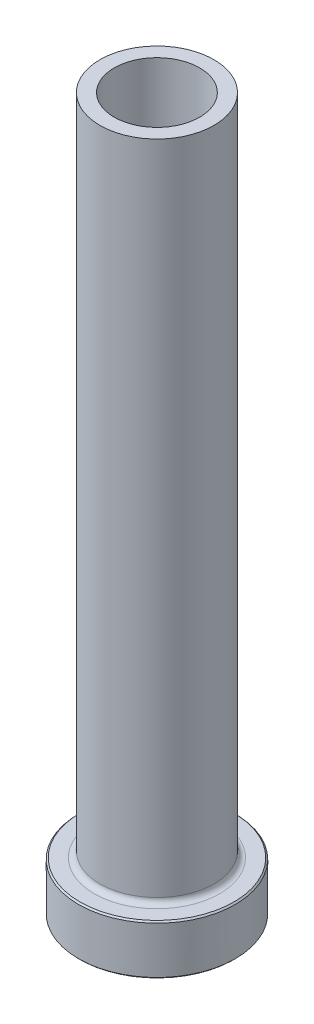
from build123d import *

# Parameters (mm, degrees)
FILLET1_R     = 0.8
CHAMFER1_SIZE = 0.2
CHAMFER3_SIZE = 0.5


with BuildPart() as part:
    # Sketch1 → Revolve1 (revolve)
    with BuildSketch(Plane.XY, mode=Mode.PRIVATE) as revolve1_sk:
        Polygon((-6, 100), (-8, 100), (-8, 7), (-11, 7), (-11, 0), (-6.25, 0), (-6.25, 33), (-6, 45), align=None)
    revolve(revolve1_sk.sketch.rotate(Axis((0, 92.187680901, 0), (0, -1, 0)), 270), axis=Axis((0, 92.187680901, 0), (0, -1, 0)))

    # Fillet1
    fillet1_edges = [part.edges().sort_by_distance(p)[0] for p in [
        (0, 7, -8),
    ]]
    fillet(fillet1_edges, radius=FILLET1_R)

    # Chamfer1
    chamfer1_edges = [part.edges().sort_by_distance(p)[0] for p in [
        (0, 0, -11),
        (0, 7, -11),
    ]]
    chamfer(chamfer1_edges, length=CHAMFER1_SIZE)

    # Chamfer3
    chamfer3_edges = [part.edges().sort_by_distance(p)[0] for p in [
        (0, 0, -6.25),
    ]]
    chamfer(chamfer3_edges, length=CHAMFER3_SIZE)


solid = part.part
